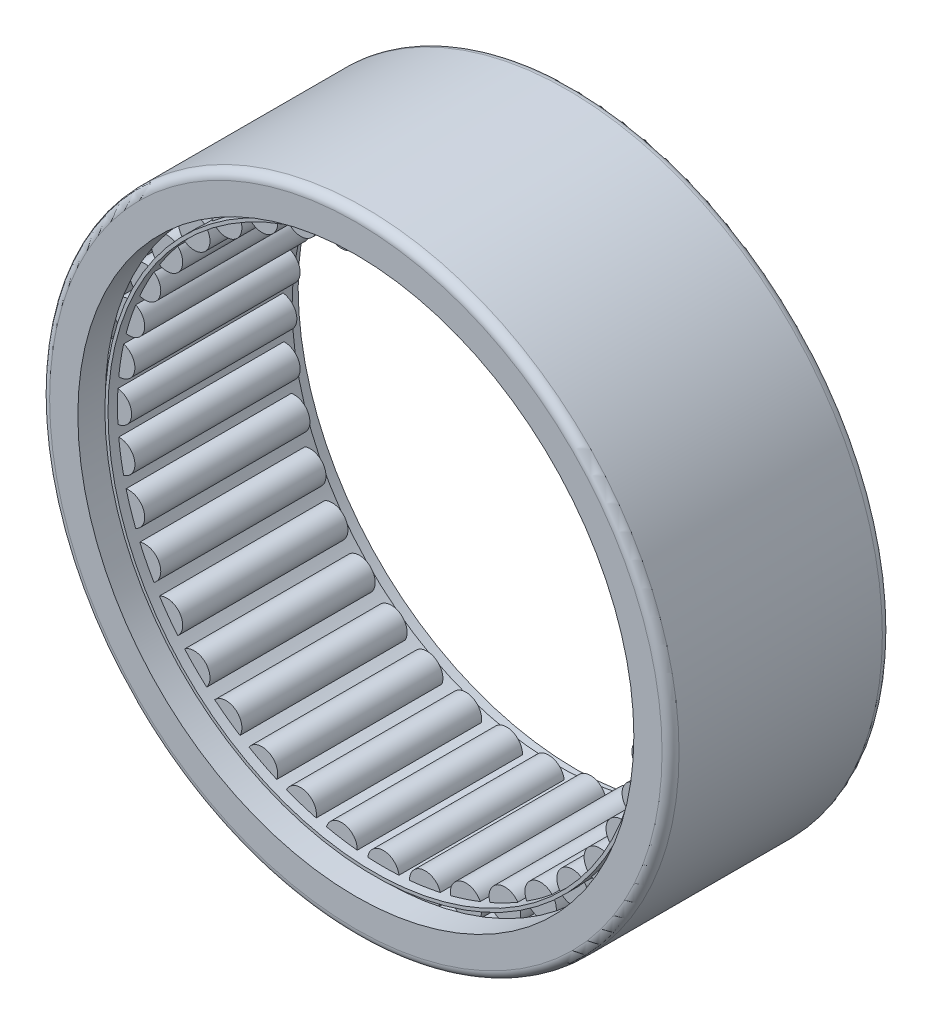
from build123d import *

# Parameters (mm, degrees)
BASESKE_W            = 26.25
BASESKE_H            = 2.5
CAGESKE_W            = 29.25
CAGESKE_H            = 0.5
FILLET1_R            = 1.35
CIRPATTERNBALL_COUNT = 40


with BuildPart() as part:
    # BaseSke → Roller (revolve)
    with BuildSketch(Plane(origin=(0, 0, 0), x_dir=(0, 0, -1), z_dir=(1, 0, 0)), mode=Mode.PRIVATE) as roller_sk:
        with Locations((0, 41.25)):
            Rectangle(BASESKE_W, BASESKE_H)
    roller = revolve(roller_sk.sketch.rotate(Axis((0, 42.5, 13.125), (0, 0, -1)), 270), axis=Axis((0, 42.5, 13.125), (0, 0, -1)))

    # OuterRaceSke → OuterRace (revolve)
    with BuildSketch(Plane(origin=(0, 0, 0), x_dir=(0, 0, -1), z_dir=(1, 0, 0)), mode=Mode.PRIVATE) as outerrace_sk:
        Polygon((-17.5, 50), (17.5, 50), (17.5, 44.166666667), (13.15, 44.166666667), (13.15, 44.98), (-13.15, 44.98), (-13.15, 44.166666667), (-17.5, 44.166666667), align=None)
    revolve(outerrace_sk.sketch.rotate(Axis((0, 0, 50.391616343), (0, 0, -1)), 90), axis=Axis((0, 0, 50.391616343), (0, 0, -1)))

    # CageSke → Cage (revolve)
    with BuildSketch(Plane(origin=(0, 0, 0), x_dir=(0, 0, -1), z_dir=(1, 0, 0)), mode=Mode.PRIVATE) as cage_sk:
        with Locations((0, 42.5)):
            Rectangle(CAGESKE_W, CAGESKE_H)
    revolve(cage_sk.sketch.rotate(Axis((0, 0, 70.862590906), (0, 0, -1)), 90), axis=Axis((0, 0, 70.862590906), (0, 0, -1)))

    # Fillet1
    fillet1_edges = [part.edges().sort_by_distance(p)[0] for p in [
        (-50, 0, 17.5),
        (-50, 0, -17.5),
    ]]
    fillet(fillet1_edges, radius=FILLET1_R)

    # CirPatternBall: Roller ×40 about axis
    cirpatternball_axis = Axis((0, 0, 0), (0, 0, 1))
    for i in range(1, CIRPATTERNBALL_COUNT):
        add(roller.rotate(cirpatternball_axis, i * 360 / CIRPATTERNBALL_COUNT))


solid = part.part
